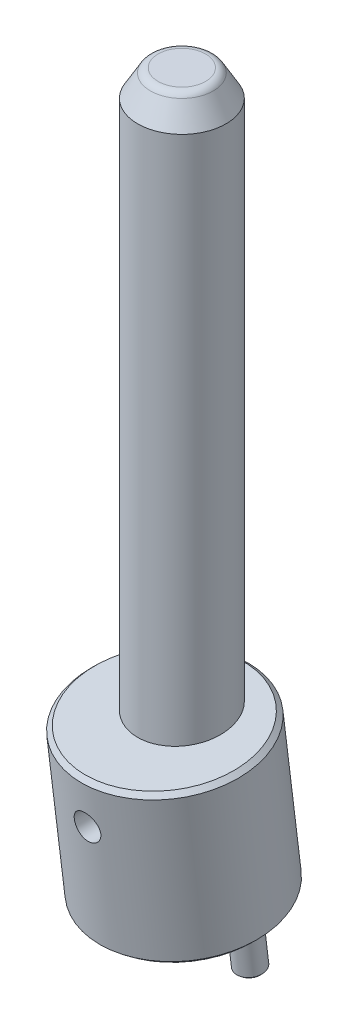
ISO-10303-21;
HEADER;
FILE_DESCRIPTION(('STEP AP214'),'2;1');
FILE_NAME('part.step','',(''),(''),'','','');
FILE_SCHEMA(('AUTOMOTIVE_DESIGN { 1 0 10303 214 1 1 1 1 }'));
ENDSEC;
DATA;
#1=APPLICATION_CONTEXT('core data for automotive mechanical design processes');
#2=APPLICATION_PROTOCOL_DEFINITION('international standard','automotive_design',2000,#1);
#3=PRODUCT_CONTEXT('',#1,'mechanical');
#4=PRODUCT('Part','Part','',(#3));
#5=PRODUCT_RELATED_PRODUCT_CATEGORY('part','',(#4));
#6=PRODUCT_DEFINITION_FORMATION('','',#4);
#7=PRODUCT_DEFINITION_CONTEXT('part definition',#1,'design');
#8=PRODUCT_DEFINITION('design','',#6,#7);
#9=PRODUCT_DEFINITION_SHAPE('','',#8);
#10=(LENGTH_UNIT() NAMED_UNIT(*) SI_UNIT(.MILLI.,.METRE.));
#11=(NAMED_UNIT(*) PLANE_ANGLE_UNIT() SI_UNIT($,.RADIAN.));
#12=(NAMED_UNIT(*) SI_UNIT($,.STERADIAN.) SOLID_ANGLE_UNIT());
#13=UNCERTAINTY_MEASURE_WITH_UNIT(LENGTH_MEASURE(1.E-05),#10,'distance_accuracy_value','');
#14=(GEOMETRIC_REPRESENTATION_CONTEXT(3) GLOBAL_UNCERTAINTY_ASSIGNED_CONTEXT((#13)) GLOBAL_UNIT_ASSIGNED_CONTEXT((#10,
#11,#12)) REPRESENTATION_CONTEXT('',''));
#15=CARTESIAN_POINT('',(0.,0.,0.));
#16=DIRECTION('',(0.,0.,1.));
#17=DIRECTION('',(1.,0.,0.));
#18=AXIS2_PLACEMENT_3D('',#15,#16,#17);
#19=CARTESIAN_POINT('',(0.,155.,0.));
#20=DIRECTION('',(0.,1.,0.));
#21=DIRECTION('',(-1.,0.,0.));
#22=AXIS2_PLACEMENT_3D('',#19,#20,#21);
#23=PLANE('',#22);
#24=CARTESIAN_POINT('',(0.,155.,0.));
#25=DIRECTION('',(0.,-1.,0.));
#26=DIRECTION('',(0.,0.,-1.));
#27=AXIS2_PLACEMENT_3D('',#24,#25,#26);
#28=CIRCLE('',#27,5.38119780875);
#29=CARTESIAN_POINT('',(0.,155.,-5.3811978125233));
#30=VERTEX_POINT('',#29);
#31=CARTESIAN_POINT('',(0.,155.,5.3811978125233));
#32=VERTEX_POINT('',#31);
#33=EDGE_CURVE('P0_E38',#30,#32,#28,.T.);
#34=ORIENTED_EDGE('',*,*,#33,.F.);
#35=CARTESIAN_POINT('',(0.,155.,0.));
#36=DIRECTION('',(0.,-1.,0.));
#37=DIRECTION('',(0.,0.,1.));
#38=AXIS2_PLACEMENT_3D('',#35,#36,#37);
#39=CIRCLE('',#38,5.38119780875);
#40=EDGE_CURVE('P0_E42',#32,#30,#39,.T.);
#41=ORIENTED_EDGE('',*,*,#40,.F.);
#42=EDGE_LOOP('',(#34,#41));
#43=FACE_BOUND('',#42,.T.);
#44=ADVANCED_FACE('P0_F17',(#43),#23,.T.);
#45=CARTESIAN_POINT('',(0.,153.,0.));
#46=DIRECTION('',(0.,1.,0.));
#47=DIRECTION('',(0.00894115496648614,0.,0.999960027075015));
#48=AXIS2_PLACEMENT_3D('',#45,#46,#47);
#49=TOROIDAL_SURFACE('',#48,5.381197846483,2.);
#50=ORIENTED_EDGE('',*,*,#33,.T.);
#51=ORIENTED_EDGE('',*,*,#40,.T.);
#52=EDGE_LOOP('',(#50,#51));
#53=FACE_BOUND('',#52,.T.);
#54=CARTESIAN_POINT('',(0.,154.000000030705,0.));
#55=DIRECTION('',(0.,-1.,0.));
#56=DIRECTION('',(0.,0.,1.));
#57=AXIS2_PLACEMENT_3D('',#54,#55,#56);
#58=CIRCLE('',#57,7.11324863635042);
#59=CARTESIAN_POINT('',(0.,154.000000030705,7.11324863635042));
#60=VERTEX_POINT('',#59);
#61=EDGE_CURVE('P0_E48',#60,#60,#58,.T.);
#62=ORIENTED_EDGE('',*,*,#61,.F.);
#63=EDGE_LOOP('',(#62));
#64=FACE_BOUND('',#63,.T.);
#65=ADVANCED_FACE('P0_F40',(#53,#64),#49,.T.);
#66=CARTESIAN_POINT('',(0.,0.,0.));
#67=DIRECTION('',(0.,1.,0.));
#68=DIRECTION('',(-1.,0.,0.));
#69=AXIS2_PLACEMENT_3D('',#66,#67,#68);
#70=PLANE('',#69);
#71=CARTESIAN_POINT('',(0.,3.21873874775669E-07,0.));
#72=DIRECTION('',(0.,1.,0.));
#73=DIRECTION('',(-1.,0.,0.));
#74=AXIS2_PLACEMENT_3D('',#71,#72,#73);
#75=CIRCLE('',#74,8.99999919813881);
#76=CARTESIAN_POINT('',(-8.99999919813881,3.21873874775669E-07,0.));
#77=VERTEX_POINT('',#76);
#78=EDGE_CURVE('P0_E85',#77,#77,#75,.T.);
#79=ORIENTED_EDGE('',*,*,#78,.F.);
#80=EDGE_LOOP('',(#79));
#81=FACE_BOUND('',#80,.T.);
#82=ADVANCED_FACE('P0_F76',(#81),#70,.F.);
#83=CARTESIAN_POINT('',(0.,17.,3.73205080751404));
#84=DIRECTION('',(0.,0.,1.));
#85=DIRECTION('',(-1.,0.,0.));
#86=AXIS2_PLACEMENT_3D('',#83,#84,#85);
#87=CONICAL_SURFACE('',#86,2.99999999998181,1.04719755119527);
#88=CARTESIAN_POINT('',(0.,16.9999999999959,1.99999999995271));
#89=VERTEX_POINT('',#88);
#90=VERTEX_LOOP('',#89);
#91=FACE_BOUND('',#90,.T.);
#92=CARTESIAN_POINT('',(0.,17.,3.732050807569));
#93=DIRECTION('',(0.,0.,1.));
#94=DIRECTION('',(0.,-1.,0.));
#95=AXIS2_PLACEMENT_3D('',#92,#93,#94);
#96=CIRCLE('',#95,3.);
#97=CARTESIAN_POINT('',(0.,14.,3.732050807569));
#98=VERTEX_POINT('',#97);
#99=EDGE_CURVE('P0_E82',#98,#98,#96,.T.);
#100=ORIENTED_EDGE('',*,*,#99,.T.);
#101=EDGE_LOOP('',(#100));
#102=FACE_BOUND('',#101,.T.);
#103=ADVANCED_FACE('P0_F116',(#91,#102),#87,.F.);
#104=CARTESIAN_POINT('',(0.,149.000000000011,0.));
#105=DIRECTION('',(0.,-1.,0.));
#106=DIRECTION('',(1.,0.,0.));
#107=AXIS2_PLACEMENT_3D('',#104,#105,#106);
#108=CONICAL_SURFACE('',#107,10.0000000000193,0.5235987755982);
#109=CARTESIAN_POINT('',(0.,149.,0.));
#110=DIRECTION('',(0.,1.,0.));
#111=DIRECTION('',(-1.,0.,0.));
#112=AXIS2_PLACEMENT_3D('',#109,#110,#111);
#113=CIRCLE('',#112,10.);
#114=CARTESIAN_POINT('',(-10.,149.,0.));
#115=VERTEX_POINT('',#114);
#116=EDGE_CURVE('P0_E92',#115,#115,#113,.F.);
#117=ORIENTED_EDGE('',*,*,#116,.F.);
#118=EDGE_LOOP('',(#117));
#119=FACE_BOUND('',#118,.T.);
#120=ORIENTED_EDGE('',*,*,#61,.T.);
#121=EDGE_LOOP('',(#120));
#122=FACE_BOUND('',#121,.T.);
#123=ADVANCED_FACE('P0_F108',(#119,#122),#108,.T.);
#124=CARTESIAN_POINT('',(0.,1.00000089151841,0.));
#125=DIRECTION('',(0.,1.,0.));
#126=DIRECTION('',(-1.,0.,0.));
#127=AXIS2_PLACEMENT_3D('',#124,#125,#126);
#128=CONICAL_SURFACE('',#127,9.99999964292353,0.785398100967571);
#129=CARTESIAN_POINT('',(0.,1.000000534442,0.));
#130=DIRECTION('',(0.,1.,0.));
#131=DIRECTION('',(-1.,0.,0.));
#132=AXIS2_PLACEMENT_3D('',#129,#130,#131);
#133=CIRCLE('',#132,10.);
#134=CARTESIAN_POINT('',(-10.,1.000000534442,0.));
#135=VERTEX_POINT('',#134);
#136=EDGE_CURVE('P0_E28',#135,#135,#133,.T.);
#137=ORIENTED_EDGE('',*,*,#136,.F.);
#138=EDGE_LOOP('',(#137));
#139=FACE_BOUND('',#138,.T.);
#140=ORIENTED_EDGE('',*,*,#78,.T.);
#141=EDGE_LOOP('',(#140));
#142=FACE_BOUND('',#141,.T.);
#143=ADVANCED_FACE('P0_F105',(#139,#142),#128,.T.);
#144=CARTESIAN_POINT('',(0.,17.,1.5));
#145=DIRECTION('',(0.,0.,1.));
#146=DIRECTION('',(0.,-1.,0.));
#147=AXIS2_PLACEMENT_3D('',#144,#145,#146);
#148=CYLINDRICAL_SURFACE('',#147,3.);
#149=ORIENTED_EDGE('',*,*,#99,.F.);
#150=EDGE_LOOP('',(#149));
#151=FACE_BOUND('',#150,.T.);
#152=CARTESIAN_POINT('',(0.,14.,10.));
#153=CARTESIAN_POINT('',(-0.164364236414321,14.0000089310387,9.99999407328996));
#154=CARTESIAN_POINT('',(-0.328908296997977,14.0135695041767,9.99590322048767));
#155=CARTESIAN_POINT('',(-0.653366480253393,14.0673818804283,9.9799606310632));
#156=CARTESIAN_POINT('',(-0.813271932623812,14.1076806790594,9.96809523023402));
#157=CARTESIAN_POINT('',(-1.12348315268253,14.2135007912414,9.93790838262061));
#158=CARTESIAN_POINT('',(-1.27380789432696,14.2789703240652,9.91960019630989));
#159=CARTESIAN_POINT('',(-1.56129290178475,14.4330996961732,9.87843514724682));
#160=CARTESIAN_POINT('',(-1.69845550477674,14.5217554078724,9.85557909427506));
#161=CARTESIAN_POINT('',(-1.95973946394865,14.7224452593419,9.80701539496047));
#162=CARTESIAN_POINT('',(-2.08342924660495,14.8350271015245,9.78124907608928));
#163=CARTESIAN_POINT('',(-2.31049290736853,15.0792112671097,9.73011807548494));
#164=CARTESIAN_POINT('',(-2.41386225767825,15.2108178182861,9.70475348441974));
#165=CARTESIAN_POINT('',(-2.59960101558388,15.4929419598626,9.65668220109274));
#166=CARTESIAN_POINT('',(-2.68144668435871,15.6438178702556,9.63404799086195));
#167=CARTESIAN_POINT('',(-2.81842825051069,15.9579795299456,9.59487230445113));
#168=CARTESIAN_POINT('',(-2.87357072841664,16.1212622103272,9.57832932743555));
#169=CARTESIAN_POINT('',(-2.95403265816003,16.4507804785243,9.5538174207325));
#170=CARTESIAN_POINT('',(-2.98014390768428,16.6168053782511,9.54562139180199));
#171=CARTESIAN_POINT('',(-3.00427461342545,16.9510662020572,9.53805579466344));
#172=CARTESIAN_POINT('',(-3.00230085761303,17.1193015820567,9.53868409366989));
#173=CARTESIAN_POINT('',(-2.9709395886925,17.4467673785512,9.54849486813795));
#174=CARTESIAN_POINT('',(-2.94254427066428,17.6061036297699,9.55736772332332));
#175=CARTESIAN_POINT('',(-2.86074869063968,17.9176387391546,9.58216703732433));
#176=CARTESIAN_POINT('',(-2.80734582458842,18.0698368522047,9.59809423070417));
#177=CARTESIAN_POINT('',(-2.67631861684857,18.3652051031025,9.6354552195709));
#178=CARTESIAN_POINT('',(-2.59837186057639,18.5082226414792,9.65696160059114));
#179=CARTESIAN_POINT('',(-2.42069837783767,18.7794716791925,9.70302119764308));
#180=CARTESIAN_POINT('',(-2.32096766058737,18.9077004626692,9.7275749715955));
#181=CARTESIAN_POINT('',(-2.09764727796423,19.1513495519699,9.77821549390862));
#182=CARTESIAN_POINT('',(-1.97323765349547,19.2660150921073,9.80432352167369));
#183=CARTESIAN_POINT('',(-1.7065766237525,19.4730741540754,9.85423611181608));
#184=CARTESIAN_POINT('',(-1.56431758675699,19.5654580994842,9.87803968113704));
#185=CARTESIAN_POINT('',(-1.26458300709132,19.7257915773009,9.92088257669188));
#186=CARTESIAN_POINT('',(-1.10700242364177,19.7935547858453,9.93988525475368));
#187=CARTESIAN_POINT('',(-0.782158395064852,19.9012737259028,9.97069163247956));
#188=CARTESIAN_POINT('',(-0.61491570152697,19.9412868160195,9.9825101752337));
#189=CARTESIAN_POINT('',(-0.371824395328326,19.9778051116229,9.99335985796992));
#190=CARTESIAN_POINT('',(-0.297737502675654,19.9861188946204,9.99584304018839));
#191=CARTESIAN_POINT('',(-0.14911274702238,19.9972183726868,9.99916445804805));
#192=CARTESIAN_POINT('',(-0.0745748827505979,20.000004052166,10.0000026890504));
#193=CARTESIAN_POINT('',(0.164364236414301,19.9999910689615,9.99999407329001));
#194=CARTESIAN_POINT('',(0.328908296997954,19.9864304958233,9.99590322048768));
#195=CARTESIAN_POINT('',(0.653366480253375,19.9326181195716,9.97996063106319));
#196=CARTESIAN_POINT('',(0.813271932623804,19.8923193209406,9.96809523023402));
#197=CARTESIAN_POINT('',(1.12348315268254,19.7864992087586,9.93790838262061));
#198=CARTESIAN_POINT('',(1.27380789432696,19.7210296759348,9.91960019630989));
#199=CARTESIAN_POINT('',(1.56129290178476,19.5669003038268,9.87843514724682));
#200=CARTESIAN_POINT('',(1.69845550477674,19.4782445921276,9.85557909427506));
#201=CARTESIAN_POINT('',(1.95973946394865,19.2775547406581,9.80701539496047));
#202=CARTESIAN_POINT('',(2.08342924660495,19.1649728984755,9.78124907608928));
#203=CARTESIAN_POINT('',(2.31049290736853,18.9207887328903,9.73011807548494));
#204=CARTESIAN_POINT('',(2.41386225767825,18.7891821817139,9.70475348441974));
#205=CARTESIAN_POINT('',(2.59960101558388,18.5070580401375,9.65668220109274));
#206=CARTESIAN_POINT('',(2.68144668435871,18.3561821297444,9.63404799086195));
#207=CARTESIAN_POINT('',(2.81842825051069,18.0420204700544,9.59487230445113));
#208=CARTESIAN_POINT('',(2.87357072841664,17.8787377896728,9.57832932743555));
#209=CARTESIAN_POINT('',(2.95403265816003,17.5492195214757,9.5538174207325));
#210=CARTESIAN_POINT('',(2.98014390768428,17.3831946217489,9.54562139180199));
#211=CARTESIAN_POINT('',(3.00427461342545,17.0489337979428,9.53805579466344));
#212=CARTESIAN_POINT('',(3.00230085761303,16.8806984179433,9.53868409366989));
#213=CARTESIAN_POINT('',(2.9709395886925,16.5532326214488,9.54849486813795));
#214=CARTESIAN_POINT('',(2.94254427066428,16.3938963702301,9.55736772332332));
#215=CARTESIAN_POINT('',(2.86074869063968,16.0823612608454,9.58216703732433));
#216=CARTESIAN_POINT('',(2.80734582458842,15.9301631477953,9.59809423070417));
#217=CARTESIAN_POINT('',(2.67631861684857,15.6347948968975,9.6354552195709));
#218=CARTESIAN_POINT('',(2.59837186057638,15.4917773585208,9.65696160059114));
#219=CARTESIAN_POINT('',(2.42069837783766,15.2205283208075,9.70302119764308));
#220=CARTESIAN_POINT('',(2.32096766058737,15.0922995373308,9.7275749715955));
#221=CARTESIAN_POINT('',(2.09764727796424,14.8486504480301,9.77821549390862));
#222=CARTESIAN_POINT('',(1.97323765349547,14.7339849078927,9.80432352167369));
#223=CARTESIAN_POINT('',(1.7065766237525,14.5269258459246,9.85423611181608));
#224=CARTESIAN_POINT('',(1.56431758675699,14.4345419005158,9.87803968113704));
#225=CARTESIAN_POINT('',(1.26458300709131,14.2742084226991,9.92088257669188));
#226=CARTESIAN_POINT('',(1.10700242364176,14.2064452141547,9.93988525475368));
#227=CARTESIAN_POINT('',(0.782158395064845,14.0987262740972,9.97069163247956));
#228=CARTESIAN_POINT('',(0.614915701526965,14.0587131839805,9.9825101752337));
#229=CARTESIAN_POINT('',(0.371824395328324,14.0221948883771,9.99335985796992));
#230=CARTESIAN_POINT('',(0.297737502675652,14.0138811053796,9.9958430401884));
#231=CARTESIAN_POINT('',(0.149112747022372,14.0027816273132,9.99916445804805));
#232=CARTESIAN_POINT('',(0.0745748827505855,13.999995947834,10.0000026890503));
#233=CARTESIAN_POINT('',(0.,14.,10.));
#234=B_SPLINE_CURVE_WITH_KNOTS('',3,(#152,#153,#154,#155,#156,#157,#158,#159,#160,#161,#162,
#163,#164,#165,#166,#167,#168,#169,#170,#171,#172,#173,#174,#175,#176,#177,#178,#179,#180,#181,
#182,#183,#184,#185,#186,#187,#188,#189,#190,#191,#192,#193,#194,#195,#196,#197,#198,#199,#200,
#201,#202,#203,#204,#205,#206,#207,#208,#209,#210,#211,#212,#213,#214,#215,#216,#217,#218,#219,
#220,#221,#222,#223,#224,#225,#226,#227,#228,#229,#230,#231,#232,#233),.UNSPECIFIED.,.T.,.F.,(4,
2,2,2,2,2,2,2,2,2,2,2,2,2,2,2,2,2,2,2,2,2,2,2,2,2,2,2,2,2,2,2,2,2,2,2,2,2,2,2,4),(0.,
0.49280574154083,0.98647994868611,1.47914396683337,1.97172034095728,2.47709830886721,
2.98258875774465,3.49943124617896,4.01614630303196,4.51839363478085,5.02051957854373,
5.50451902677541,5.98856888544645,6.47926306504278,6.97004721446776,7.48124851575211,
7.99266913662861,8.507883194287,9.02202912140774,9.24562293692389,9.4692173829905,
9.96202312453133,10.4556973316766,10.9483613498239,11.4409377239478,11.9463156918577,
12.4518061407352,12.9686486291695,13.4853636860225,13.9876110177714,14.4897369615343,
14.9737364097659,15.457786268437,15.9484804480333,16.4392645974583,16.9504658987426,
17.4618865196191,17.9771005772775,18.4912465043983,18.7148403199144,18.938434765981),.UNSPECIFIED.);
#235=CARTESIAN_POINT('',(0.,14.,10.));
#236=VERTEX_POINT('',#235);
#237=EDGE_CURVE('P0_E11',#236,#236,#234,.T.);
#238=ORIENTED_EDGE('',*,*,#237,.F.);
#239=EDGE_LOOP('',(#238));
#240=FACE_BOUND('',#239,.T.);
#241=ADVANCED_FACE('P0_F107',(#151,#240),#148,.F.);
#242=CARTESIAN_POINT('',(0.,-7.75,0.));
#243=DIRECTION('',(0.,1.,0.));
#244=DIRECTION('',(-1.,0.,0.));
#245=AXIS2_PLACEMENT_3D('',#242,#243,#244);
#246=CYLINDRICAL_SURFACE('',#245,10.);
#247=ORIENTED_EDGE('',*,*,#116,.T.);
#248=EDGE_LOOP('',(#247));
#249=FACE_BOUND('',#248,.T.);
#250=ORIENTED_EDGE('',*,*,#136,.T.);
#251=EDGE_LOOP('',(#250));
#252=FACE_BOUND('',#251,.T.);
#253=ORIENTED_EDGE('',*,*,#237,.T.);
#254=EDGE_LOOP('',(#253));
#255=FACE_BOUND('',#254,.T.);
#256=ADVANCED_FACE('P0_F102',(#249,#252,#255),#246,.T.);
#257=CLOSED_SHELL('',(#44,#65,#82,#103,#123,#143,#241,#256));
#258=MANIFOLD_SOLID_BREP('P0_B1',#257);
#259=CARTESIAN_POINT('',(0.,-15.1520541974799,-1.51393584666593));
#260=DIRECTION('',(0.,-0.992546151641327,-0.121869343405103));
#261=DIRECTION('',(0.,0.121869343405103,-0.992546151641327));
#262=AXIS2_PLACEMENT_3D('',#259,#260,#261);
#263=PLANE('',#262);
#264=CARTESIAN_POINT('',(-14.,-15.1520541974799,-1.51393584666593));
#265=DIRECTION('',(0.,-0.992546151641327,-0.121869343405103));
#266=DIRECTION('',(0.,0.121869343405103,-0.992546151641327));
#267=AXIS2_PLACEMENT_3D('',#264,#265,#266);
#268=CIRCLE('',#267,2.49998893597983);
#269=CARTESIAN_POINT('',(-14.,-14.8473821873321,-3.99529024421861));
#270=VERTEX_POINT('',#269);
#271=EDGE_CURVE('P1_E17',#270,#270,#268,.F.);
#272=ORIENTED_EDGE('',*,*,#271,.F.);
#273=EDGE_LOOP('',(#272));
#274=FACE_BOUND('',#273,.T.);
#275=ADVANCED_FACE('P1_F14',(#274),#263,.T.);
#276=CARTESIAN_POINT('',(0.,-15.1520541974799,-1.51393584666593));
#277=DIRECTION('',(0.,-0.992546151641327,-0.121869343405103));
#278=DIRECTION('',(0.,0.121869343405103,-0.992546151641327));
#279=AXIS2_PLACEMENT_3D('',#276,#277,#278);
#280=PLANE('',#279);
#281=CARTESIAN_POINT('',(14.,-15.1520541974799,-1.51393584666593));
#282=DIRECTION('',(0.,-0.992546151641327,-0.121869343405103));
#283=DIRECTION('',(0.,0.121869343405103,-0.992546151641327));
#284=AXIS2_PLACEMENT_3D('',#281,#282,#283);
#285=CIRCLE('',#284,2.49998893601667);
#286=CARTESIAN_POINT('',(14.,-14.8473821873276,-3.99529024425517));
#287=VERTEX_POINT('',#286);
#288=EDGE_CURVE('P1_E114',#287,#287,#285,.F.);
#289=ORIENTED_EDGE('',*,*,#288,.F.);
#290=EDGE_LOOP('',(#289));
#291=FACE_BOUND('',#290,.T.);
#292=ADVANCED_FACE('P1_F104',(#291),#280,.T.);
#293=CARTESIAN_POINT('',(0.,-1.32706345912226E-13,-3.20815422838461E-13));
#294=DIRECTION('',(0.,-1.,0.));
#295=DIRECTION('',(0.,0.,-1.));
#296=AXIS2_PLACEMENT_3D('',#293,#294,#295);
#297=PLANE('',#296);
#298=CARTESIAN_POINT('',(0.,0.,-2.03098171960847E-12));
#299=DIRECTION('',(0.,-1.,0.));
#300=DIRECTION('',(0.,0.,-1.));
#301=AXIS2_PLACEMENT_3D('',#298,#299,#300);
#302=CIRCLE('',#301,10.);
#303=CARTESIAN_POINT('',(0.,0.,-10.000000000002));
#304=VERTEX_POINT('',#303);
#305=EDGE_CURVE('P1_E116',#304,#304,#302,.F.);
#306=ORIENTED_EDGE('',*,*,#305,.T.);
#307=EDGE_LOOP('',(#306));
#308=FACE_BOUND('',#307,.T.);
#309=ADVANCED_FACE('P1_F101',(#308),#297,.F.);
#310=CARTESIAN_POINT('',(-14.,-14.6557726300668,-1.45300013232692));
#311=DIRECTION('',(0.,0.992546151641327,0.121869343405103));
#312=DIRECTION('',(0.,-0.121869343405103,0.992546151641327));
#313=AXIS2_PLACEMENT_3D('',#310,#311,#312);
#314=CONICAL_SURFACE('',#313,2.99999527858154,0.785395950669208);
#315=CARTESIAN_POINT('',(-14.,-14.6557679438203,-1.4529995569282));
#316=DIRECTION('',(0.,0.992546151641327,0.121869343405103));
#317=DIRECTION('',(0.,-0.121869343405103,0.992546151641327));
#318=AXIS2_PLACEMENT_3D('',#315,#316,#317);
#319=CIRCLE('',#318,3.);
#320=CARTESIAN_POINT('',(-14.,-15.0213759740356,1.52463889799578));
#321=VERTEX_POINT('',#320);
#322=EDGE_CURVE('P1_E118',#321,#321,#319,.T.);
#323=ORIENTED_EDGE('',*,*,#322,.F.);
#324=EDGE_LOOP('',(#323));
#325=FACE_BOUND('',#324,.T.);
#326=ORIENTED_EDGE('',*,*,#271,.T.);
#327=EDGE_LOOP('',(#326));
#328=FACE_BOUND('',#327,.T.);
#329=ADVANCED_FACE('P1_F97',(#325,#328),#314,.T.);
#330=CARTESIAN_POINT('',(14.,-14.6557726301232,-1.45300013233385));
#331=DIRECTION('',(0.,0.992546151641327,0.121869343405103));
#332=DIRECTION('',(0.,-0.121869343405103,0.992546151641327));
#333=AXIS2_PLACEMENT_3D('',#330,#331,#332);
#334=CONICAL_SURFACE('',#333,2.99999527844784,0.785395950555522);
#335=CARTESIAN_POINT('',(14.,-14.655767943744,-1.45299955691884));
#336=DIRECTION('',(0.,0.992546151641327,0.121869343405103));
#337=DIRECTION('',(0.,-0.121869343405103,0.992546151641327));
#338=AXIS2_PLACEMENT_3D('',#335,#336,#337);
#339=CIRCLE('',#338,3.);
#340=CARTESIAN_POINT('',(14.,-15.0213759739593,1.52463889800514));
#341=VERTEX_POINT('',#340);
#342=EDGE_CURVE('P1_E123',#341,#341,#339,.T.);
#343=ORIENTED_EDGE('',*,*,#342,.F.);
#344=EDGE_LOOP('',(#343));
#345=FACE_BOUND('',#344,.T.);
#346=ORIENTED_EDGE('',*,*,#288,.T.);
#347=EDGE_LOOP('',(#346));
#348=FACE_BOUND('',#347,.T.);
#349=ADVANCED_FACE('P1_F92',(#345,#348),#334,.T.);
#350=CARTESIAN_POINT('',(0.,43.3305704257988,-2.03092750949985E-12));
#351=DIRECTION('',(0.,-1.,0.));
#352=DIRECTION('',(0.,0.,-1.));
#353=AXIS2_PLACEMENT_3D('',#350,#351,#352);
#354=CYLINDRICAL_SURFACE('',#353,10.);
#355=CARTESIAN_POINT('',(0.,30.0000000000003,-2.03092750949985E-12));
#356=DIRECTION('',(0.,0.992546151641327,0.121869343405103));
#357=DIRECTION('',(0.,-0.121869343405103,0.992546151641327));
#358=AXIS2_PLACEMENT_3D('',#355,#356,#357);
#359=ELLIPSE('',#358,10.0750982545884,10.);
#360=CARTESIAN_POINT('',(0.,28.7721543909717,9.99999999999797));
#361=VERTEX_POINT('',#360);
#362=EDGE_CURVE('P1_E79',#361,#361,#359,.F.);
#363=ORIENTED_EDGE('',*,*,#362,.F.);
#364=EDGE_LOOP('',(#363));
#365=FACE_BOUND('',#364,.T.);
#366=ORIENTED_EDGE('',*,*,#305,.F.);
#367=EDGE_LOOP('',(#366));
#368=FACE_BOUND('',#367,.T.);
#369=CARTESIAN_POINT('',(0.,20.0000000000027,9.99999999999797));
#370=CARTESIAN_POINT('',(-0.16436423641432,19.999991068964,9.99999407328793));
#371=CARTESIAN_POINT('',(-0.328908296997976,19.986430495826,9.99590322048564));
#372=CARTESIAN_POINT('',(-0.653366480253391,19.9326181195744,9.97996063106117));
#373=CARTESIAN_POINT('',(-0.81327193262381,19.8923193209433,9.96809523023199));
#374=CARTESIAN_POINT('',(-1.12348315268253,19.7864992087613,9.93790838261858));
#375=CARTESIAN_POINT('',(-1.27380789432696,19.7210296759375,9.91960019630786));
#376=CARTESIAN_POINT('',(-1.56129290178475,19.5669003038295,9.87843514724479));
#377=CARTESIAN_POINT('',(-1.69845550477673,19.4782445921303,9.85557909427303));
#378=CARTESIAN_POINT('',(-1.95973946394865,19.2775547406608,9.80701539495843));
#379=CARTESIAN_POINT('',(-2.08342924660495,19.1649728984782,9.78124907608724));
#380=CARTESIAN_POINT('',(-2.31049290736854,18.920788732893,9.73011807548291));
#381=CARTESIAN_POINT('',(-2.41386225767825,18.7891821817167,9.70475348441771));
#382=CARTESIAN_POINT('',(-2.59960101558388,18.5070580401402,9.65668220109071));
#383=CARTESIAN_POINT('',(-2.68144668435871,18.3561821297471,9.63404799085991));
#384=CARTESIAN_POINT('',(-2.81842825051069,18.0420204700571,9.5948723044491));
#385=CARTESIAN_POINT('',(-2.87357072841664,17.8787377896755,9.57832932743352));
#386=CARTESIAN_POINT('',(-2.95403265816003,17.5492195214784,9.55381742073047));
#387=CARTESIAN_POINT('',(-2.98014390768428,17.3831946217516,9.54562139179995));
#388=CARTESIAN_POINT('',(-3.00427461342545,17.0489337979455,9.53805579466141));
#389=CARTESIAN_POINT('',(-3.00230085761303,16.8806984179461,9.53868409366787));
#390=CARTESIAN_POINT('',(-2.9709395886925,16.5532326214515,9.54849486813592));
#391=CARTESIAN_POINT('',(-2.94254427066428,16.3938963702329,9.55736772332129));
#392=CARTESIAN_POINT('',(-2.86074869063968,16.0823612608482,9.5821670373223));
#393=CARTESIAN_POINT('',(-2.80734582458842,15.9301631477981,9.59809423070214));
#394=CARTESIAN_POINT('',(-2.67631861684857,15.6347948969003,9.63545521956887));
#395=CARTESIAN_POINT('',(-2.59837186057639,15.4917773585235,9.65696160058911));
#396=CARTESIAN_POINT('',(-2.42069837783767,15.2205283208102,9.70302119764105));
#397=CARTESIAN_POINT('',(-2.32096766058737,15.0922995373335,9.72757497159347));
#398=CARTESIAN_POINT('',(-2.09764727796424,14.8486504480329,9.77821549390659));
#399=CARTESIAN_POINT('',(-1.97323765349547,14.7339849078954,9.80432352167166));
#400=CARTESIAN_POINT('',(-1.7065766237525,14.5269258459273,9.85423611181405));
#401=CARTESIAN_POINT('',(-1.56431758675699,14.4345419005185,9.87803968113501));
#402=CARTESIAN_POINT('',(-1.26458300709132,14.2742084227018,9.92088257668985));
#403=CARTESIAN_POINT('',(-1.10700242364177,14.2064452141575,9.93988525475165));
#404=CARTESIAN_POINT('',(-0.782158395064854,14.0987262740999,9.97069163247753));
#405=CARTESIAN_POINT('',(-0.614915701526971,14.0587131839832,9.98251017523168));
#406=CARTESIAN_POINT('',(-0.371824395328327,14.0221948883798,9.99335985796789));
#407=CARTESIAN_POINT('',(-0.297737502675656,14.0138811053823,9.99584304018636));
#408=CARTESIAN_POINT('',(-0.149112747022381,14.0027816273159,9.99916445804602));
#409=CARTESIAN_POINT('',(-0.0745748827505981,13.9999959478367,10.0000026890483));
#410=CARTESIAN_POINT('',(0.164364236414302,14.0000089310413,9.99999407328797));
#411=CARTESIAN_POINT('',(0.328908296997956,14.0135695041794,9.99590322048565));
#412=CARTESIAN_POINT('',(0.653366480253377,14.0673818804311,9.97996063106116));
#413=CARTESIAN_POINT('',(0.813271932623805,14.1076806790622,9.96809523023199));
#414=CARTESIAN_POINT('',(1.12348315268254,14.2135007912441,9.93790838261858));
#415=CARTESIAN_POINT('',(1.27380789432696,14.2789703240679,9.91960019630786));
#416=CARTESIAN_POINT('',(1.56129290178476,14.4330996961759,9.87843514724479));
#417=CARTESIAN_POINT('',(1.69845550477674,14.5217554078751,9.85557909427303));
#418=CARTESIAN_POINT('',(1.95973946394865,14.7224452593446,9.80701539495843));
#419=CARTESIAN_POINT('',(2.08342924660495,14.8350271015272,9.78124907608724));
#420=CARTESIAN_POINT('',(2.31049290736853,15.0792112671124,9.73011807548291));
#421=CARTESIAN_POINT('',(2.41386225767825,15.2108178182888,9.70475348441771));
#422=CARTESIAN_POINT('',(2.59960101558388,15.4929419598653,9.65668220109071));
#423=CARTESIAN_POINT('',(2.68144668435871,15.6438178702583,9.63404799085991));
#424=CARTESIAN_POINT('',(2.81842825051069,15.9579795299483,9.5948723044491));
#425=CARTESIAN_POINT('',(2.87357072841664,16.1212622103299,9.57832932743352));
#426=CARTESIAN_POINT('',(2.95403265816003,16.450780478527,9.55381742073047));
#427=CARTESIAN_POINT('',(2.98014390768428,16.6168053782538,9.54562139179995));
#428=CARTESIAN_POINT('',(3.00427461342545,16.9510662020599,9.53805579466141));
#429=CARTESIAN_POINT('',(3.00230085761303,17.1193015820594,9.53868409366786));
#430=CARTESIAN_POINT('',(2.9709395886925,17.4467673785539,9.54849486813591));
#431=CARTESIAN_POINT('',(2.94254427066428,17.6061036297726,9.55736772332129));
#432=CARTESIAN_POINT('',(2.86074869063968,17.9176387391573,9.5821670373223));
#433=CARTESIAN_POINT('',(2.80734582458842,18.0698368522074,9.59809423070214));
#434=CARTESIAN_POINT('',(2.67631861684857,18.3652051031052,9.63545521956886));
#435=CARTESIAN_POINT('',(2.59837186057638,18.5082226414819,9.65696160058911));
#436=CARTESIAN_POINT('',(2.42069837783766,18.7794716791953,9.70302119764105));
#437=CARTESIAN_POINT('',(2.32096766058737,18.9077004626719,9.72757497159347));
#438=CARTESIAN_POINT('',(2.09764727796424,19.1513495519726,9.77821549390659));
#439=CARTESIAN_POINT('',(1.97323765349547,19.26601509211,9.80432352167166));
#440=CARTESIAN_POINT('',(1.7065766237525,19.4730741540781,9.85423611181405));
#441=CARTESIAN_POINT('',(1.56431758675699,19.5654580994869,9.87803968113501));
#442=CARTESIAN_POINT('',(1.26458300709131,19.7257915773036,9.92088257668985));
#443=CARTESIAN_POINT('',(1.10700242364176,19.793554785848,9.93988525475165));
#444=CARTESIAN_POINT('',(0.782158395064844,19.9012737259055,9.97069163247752));
#445=CARTESIAN_POINT('',(0.614915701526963,19.9412868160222,9.98251017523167));
#446=CARTESIAN_POINT('',(0.371824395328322,19.9778051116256,9.99335985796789));
#447=CARTESIAN_POINT('',(0.297737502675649,19.9861188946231,9.99584304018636));
#448=CARTESIAN_POINT('',(0.149112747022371,19.9972183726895,9.99916445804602));
#449=CARTESIAN_POINT('',(0.0745748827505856,20.0000040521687,10.0000026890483));
#450=CARTESIAN_POINT('',(0.,20.0000000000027,9.99999999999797));
#451=B_SPLINE_CURVE_WITH_KNOTS('',3,(#369,#370,#371,#372,#373,#374,#375,#376,#377,#378,#379,
#380,#381,#382,#383,#384,#385,#386,#387,#388,#389,#390,#391,#392,#393,#394,#395,#396,#397,#398,
#399,#400,#401,#402,#403,#404,#405,#406,#407,#408,#409,#410,#411,#412,#413,#414,#415,#416,#417,
#418,#419,#420,#421,#422,#423,#424,#425,#426,#427,#428,#429,#430,#431,#432,#433,#434,#435,#436,
#437,#438,#439,#440,#441,#442,#443,#444,#445,#446,#447,#448,#449,#450),.UNSPECIFIED.,.T.,.F.,(4,
2,2,2,2,2,2,2,2,2,2,2,2,2,2,2,2,2,2,2,2,2,2,2,2,2,2,2,2,2,2,2,2,2,2,2,2,2,2,2,4),(0.,
0.49280574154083,0.986479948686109,1.47914396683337,1.97172034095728,2.47709830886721,
2.98258875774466,3.49943124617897,4.01614630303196,4.51839363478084,5.02051957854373,
5.50451902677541,5.98856888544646,6.47926306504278,6.97004721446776,7.48124851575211,
7.99266913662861,8.507883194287,9.02202912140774,9.24562293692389,9.46921738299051,
9.96202312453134,10.4556973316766,10.9483613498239,11.4409377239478,11.9463156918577,
12.4518061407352,12.9686486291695,13.4853636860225,13.9876110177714,14.4897369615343,
14.9737364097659,15.457786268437,15.9484804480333,16.4392645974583,16.9504658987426,
17.4618865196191,17.9771005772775,18.4912465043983,18.7148403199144,18.9384347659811),.UNSPECIFIED.);
#452=CARTESIAN_POINT('',(0.,20.0000000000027,9.99999999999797));
#453=VERTEX_POINT('',#452);
#454=EDGE_CURVE('P1_E76',#453,#453,#451,.T.);
#455=ORIENTED_EDGE('',*,*,#454,.T.);
#456=EDGE_LOOP('',(#455));
#457=FACE_BOUND('',#456,.T.);
#458=ADVANCED_FACE('P1_F86',(#365,#368,#457),#354,.F.);
#459=CARTESIAN_POINT('',(-14.,-6.219138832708,-0.41711175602));
#460=DIRECTION('',(0.,-0.992546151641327,-0.121869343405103));
#461=DIRECTION('',(0.,0.121869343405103,-0.992546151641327));
#462=AXIS2_PLACEMENT_3D('',#459,#460,#461);
#463=CYLINDRICAL_SURFACE('',#462,3.);
#464=CARTESIAN_POINT('',(-14.,-6.219138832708,-0.41711175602));
#465=DIRECTION('',(0.,-0.992546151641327,-0.121869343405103));
#466=DIRECTION('',(0.,0.121869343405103,-0.992546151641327));
#467=AXIS2_PLACEMENT_3D('',#464,#465,#466);
#468=CIRCLE('',#467,3.);
#469=CARTESIAN_POINT('',(-14.,-5.85353080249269,-3.39475021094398));
#470=VERTEX_POINT('',#469);
#471=EDGE_CURVE('P1_E72',#470,#470,#468,.T.);
#472=ORIENTED_EDGE('',*,*,#471,.T.);
#473=EDGE_LOOP('',(#472));
#474=FACE_BOUND('',#473,.T.);
#475=ORIENTED_EDGE('',*,*,#322,.T.);
#476=EDGE_LOOP('',(#475));
#477=FACE_BOUND('',#476,.T.);
#478=ADVANCED_FACE('P1_F91',(#474,#477),#463,.T.);
#479=CARTESIAN_POINT('',(14.,-6.219138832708,-0.41711175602));
#480=DIRECTION('',(0.,-0.992546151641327,-0.121869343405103));
#481=DIRECTION('',(0.,0.121869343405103,-0.992546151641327));
#482=AXIS2_PLACEMENT_3D('',#479,#480,#481);
#483=CYLINDRICAL_SURFACE('',#482,3.);
#484=CARTESIAN_POINT('',(14.,-6.219138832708,-0.41711175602));
#485=DIRECTION('',(0.,-0.992546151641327,-0.121869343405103));
#486=DIRECTION('',(0.,0.121869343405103,-0.992546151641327));
#487=AXIS2_PLACEMENT_3D('',#484,#485,#486);
#488=CIRCLE('',#487,3.);
#489=CARTESIAN_POINT('',(14.,-5.85353080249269,-3.39475021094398));
#490=VERTEX_POINT('',#489);
#491=EDGE_CURVE('P1_E68',#490,#490,#488,.T.);
#492=ORIENTED_EDGE('',*,*,#491,.T.);
#493=EDGE_LOOP('',(#492));
#494=FACE_BOUND('',#493,.T.);
#495=ORIENTED_EDGE('',*,*,#342,.T.);
#496=EDGE_LOOP('',(#495));
#497=FACE_BOUND('',#496,.T.);
#498=ADVANCED_FACE('P1_F139',(#494,#497),#483,.T.);
#499=CARTESIAN_POINT('',(0.,29.5125226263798,3.97018460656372));
#500=DIRECTION('',(0.,0.992546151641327,0.121869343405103));
#501=DIRECTION('',(0.,-0.121869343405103,0.992546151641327));
#502=AXIS2_PLACEMENT_3D('',#499,#500,#501);
#503=PLANE('',#502);
#504=ORIENTED_EDGE('',*,*,#362,.T.);
#505=EDGE_LOOP('',(#504));
#506=FACE_BOUND('',#505,.T.);
#507=CARTESIAN_POINT('',(0.,29.5125226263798,3.9701846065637));
#508=DIRECTION('',(0.,0.992546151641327,0.121869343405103));
#509=DIRECTION('',(0.,-0.121869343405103,0.992546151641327));
#510=AXIS2_PLACEMENT_3D('',#507,#508,#509);
#511=CIRCLE('',#510,17.9999935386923);
#512=CARTESIAN_POINT('',(0.,27.3188752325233,21.8360089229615));
#513=VERTEX_POINT('',#512);
#514=EDGE_CURVE('P1_E38',#513,#513,#511,.F.);
#515=ORIENTED_EDGE('',*,*,#514,.F.);
#516=EDGE_LOOP('',(#515));
#517=FACE_BOUND('',#516,.T.);
#518=ADVANCED_FACE('P1_F63',(#506,#517),#503,.T.);
#519=CARTESIAN_POINT('',(0.,17.0000000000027,-3.70003727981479));
#520=DIRECTION('',(0.,0.,1.));
#521=DIRECTION('',(0.,-1.,0.));
#522=AXIS2_PLACEMENT_3D('',#519,#520,#521);
#523=CYLINDRICAL_SURFACE('',#522,3.);
#524=ORIENTED_EDGE('',*,*,#454,.F.);
#525=EDGE_LOOP('',(#524));
#526=FACE_BOUND('',#525,.T.);
#527=CARTESIAN_POINT('',(0.,14.0000000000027,21.2081730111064));
#528=CARTESIAN_POINT('',(-0.168375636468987,14.000007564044,21.2081708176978));
#529=CARTESIAN_POINT('',(-0.336958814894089,14.0142312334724,21.2076402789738));
#530=CARTESIAN_POINT('',(-0.669566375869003,14.0707956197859,21.2057130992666));
#531=CARTESIAN_POINT('',(-0.833581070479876,14.1131919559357,21.2043147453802));
#532=CARTESIAN_POINT('',(-1.15205522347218,14.2248959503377,21.2012396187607));
#533=CARTESIAN_POINT('',(-1.30652215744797,14.2941822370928,21.1995630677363));
#534=CARTESIAN_POINT('',(-1.60156617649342,14.4576731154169,21.1968228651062));
#535=CARTESIAN_POINT('',(-1.74214908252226,14.5518672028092,21.1957589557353));
#536=CARTESIAN_POINT('',(-2.00554261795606,14.7625371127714,21.1953276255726));
#537=CARTESIAN_POINT('',(-2.12834999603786,14.8790170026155,21.1959605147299));
#538=CARTESIAN_POINT('',(-2.3526557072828,15.1309218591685,21.2000562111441));
#539=CARTESIAN_POINT('',(-2.45415323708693,15.2663475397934,21.2035191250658));
#540=CARTESIAN_POINT('',(-2.63254643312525,15.551595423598,21.2142654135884));
#541=CARTESIAN_POINT('',(-2.70954499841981,15.7013538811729,21.2215324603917));
#542=CARTESIAN_POINT('',(-2.83737969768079,16.0113712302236,21.2405952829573));
#543=CARTESIAN_POINT('',(-2.88821737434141,16.1716295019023,21.252390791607));
#544=CARTESIAN_POINT('',(-2.96225674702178,16.4972232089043,21.2807457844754));
#545=CARTESIAN_POINT('',(-2.98558245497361,16.6625323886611,21.2972834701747));
#546=CARTESIAN_POINT('',(-3.00459042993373,16.9942055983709,21.3349508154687));
#547=CARTESIAN_POINT('',(-3.00027160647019,17.1605696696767,21.3560806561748));
#548=CARTESIAN_POINT('',(-2.9642365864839,17.4910773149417,21.4024316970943));
#549=CARTESIAN_POINT('',(-2.93230247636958,17.65519265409,21.4276841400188));
#550=CARTESIAN_POINT('',(-2.84186394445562,17.9754520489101,21.4810141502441));
#551=CARTESIAN_POINT('',(-2.78335584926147,18.1315949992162,21.5090921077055));
#552=CARTESIAN_POINT('',(-2.64001667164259,18.4349283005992,21.5671655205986));
#553=CARTESIAN_POINT('',(-2.55467438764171,18.5818719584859,21.5971883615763));
#554=CARTESIAN_POINT('',(-2.36040600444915,18.8593465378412,21.6567869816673));
#555=CARTESIAN_POINT('',(-2.25147933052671,18.9898770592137,21.6863627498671));
#556=CARTESIAN_POINT('',(-2.0116154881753,19.2322107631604,21.7434078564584));
#557=CARTESIAN_POINT('',(-1.88046287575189,19.3438068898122,21.7708523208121));
#558=CARTESIAN_POINT('',(-1.60035758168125,19.5433076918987,21.8213051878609));
#559=CARTESIAN_POINT('',(-1.45139855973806,19.6312038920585,21.8443120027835));
#560=CARTESIAN_POINT('',(-1.14272283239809,19.7790218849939,21.883718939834));
#561=CARTESIAN_POINT('',(-0.983245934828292,19.8394155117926,21.9002297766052));
#562=CARTESIAN_POINT('',(-0.656050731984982,19.9323006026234,21.9258599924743));
#563=CARTESIAN_POINT('',(-0.488353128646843,19.9648586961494,21.9349970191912));
#564=CARTESIAN_POINT('',(-0.266232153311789,19.9886415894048,21.9416818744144));
#565=CARTESIAN_POINT('',(-0.213088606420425,19.992897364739,21.9428794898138));
#566=CARTESIAN_POINT('',(-0.106637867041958,19.9985778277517,21.9444793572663));
#567=CARTESIAN_POINT('',(-0.0533306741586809,20.0000025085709,21.9448816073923));
#568=CARTESIAN_POINT('',(0.164356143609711,19.9999922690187,21.9448765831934));
#569=CARTESIAN_POINT('',(0.328935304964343,19.9864295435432,21.9410406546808));
#570=CARTESIAN_POINT('',(0.653541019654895,19.9325856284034,21.9259781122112));
#571=CARTESIAN_POINT('',(0.813557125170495,19.8922475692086,21.9147357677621));
#572=CARTESIAN_POINT('',(1.12402944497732,19.7862873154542,21.8857527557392));
#573=CARTESIAN_POINT('',(1.27450305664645,19.7207127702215,21.8680243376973));
#574=CARTESIAN_POINT('',(1.56216881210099,19.5663745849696,21.8273798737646));
#575=CARTESIAN_POINT('',(1.69936540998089,19.4776187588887,21.804465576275));
#576=CARTESIAN_POINT('',(1.95987302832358,19.2773770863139,21.7545069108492));
#577=CARTESIAN_POINT('',(2.08283374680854,19.1654547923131,21.7273862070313));
#578=CARTESIAN_POINT('',(2.30845456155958,18.9231375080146,21.6711894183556));
#579=CARTESIAN_POINT('',(2.4111098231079,18.7927381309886,21.6421128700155));
#580=CARTESIAN_POINT('',(2.59623248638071,18.5127945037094,21.5829616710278));
#581=CARTESIAN_POINT('',(2.67802121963,18.3628016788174,21.5528827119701));
#582=CARTESIAN_POINT('',(2.81509396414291,18.0508440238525,21.4944052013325));
#583=CARTESIAN_POINT('',(2.87037734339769,17.8888789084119,21.4660066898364));
#584=CARTESIAN_POINT('',(2.95281854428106,17.5569391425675,21.4123704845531));
#585=CARTESIAN_POINT('',(2.97989932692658,17.3869438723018,21.3871416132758));
#586=CARTESIAN_POINT('',(3.00458761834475,17.0442359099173,21.3410961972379));
#587=CARTESIAN_POINT('',(3.00219875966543,16.8715235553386,21.3202791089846));
#588=CARTESIAN_POINT('',(2.96806290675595,16.53183043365,21.2840404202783));
#589=CARTESIAN_POINT('',(2.93687920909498,16.3648032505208,21.2685230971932));
#590=CARTESIAN_POINT('',(2.84664339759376,16.0380535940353,21.2424022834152));
#591=CARTESIAN_POINT('',(2.7875933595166,15.8783305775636,21.2317984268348));
#592=CARTESIAN_POINT('',(2.64432821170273,15.5732906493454,21.2151852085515));
#593=CARTESIAN_POINT('',(2.56050413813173,15.427793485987,21.2091092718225));
#594=CARTESIAN_POINT('',(2.36973535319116,15.1527418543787,21.2004847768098));
#595=CARTESIAN_POINT('',(2.26279233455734,15.0231862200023,21.1979359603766));
#596=CARTESIAN_POINT('',(2.02876719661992,14.783662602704,21.1953244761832));
#597=CARTESIAN_POINT('',(1.90167888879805,14.6737006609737,21.1952625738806));
#598=CARTESIAN_POINT('',(1.63088940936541,14.4764579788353,21.1965152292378));
#599=CARTESIAN_POINT('',(1.48718067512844,14.3891876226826,21.1978304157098));
#600=CARTESIAN_POINT('',(1.18628909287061,14.2393544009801,21.2008217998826));
#601=CARTESIAN_POINT('',(1.02902570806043,14.1769536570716,21.2025002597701));
#602=CARTESIAN_POINT('',(0.706461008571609,14.0795207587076,21.2053879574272));
#603=CARTESIAN_POINT('',(0.541176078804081,14.0444351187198,21.2065981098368));
#604=CARTESIAN_POINT('',(0.312244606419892,14.0156349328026,21.2076109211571));
#605=CARTESIAN_POINT('',(0.249948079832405,14.0097763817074,21.207820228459));
#606=CARTESIAN_POINT('',(0.125110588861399,14.001957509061,21.2081016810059));
#607=CARTESIAN_POINT('',(0.0625696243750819,13.9999971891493,21.2081738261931));
#608=CARTESIAN_POINT('',(0.,14.0000000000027,21.2081730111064));
#609=B_SPLINE_CURVE_WITH_KNOTS('',3,(#527,#528,#529,#530,#531,#532,#533,#534,#535,#536,#537,
#538,#539,#540,#541,#542,#543,#544,#545,#546,#547,#548,#549,#550,#551,#552,#553,#554,#555,#556,
#557,#558,#559,#560,#561,#562,#563,#564,#565,#566,#567,#568,#569,#570,#571,#572,#573,#574,#575,
#576,#577,#578,#579,#580,#581,#582,#583,#584,#585,#586,#587,#588,#589,#590,#591,#592,#593,#594,
#595,#596,#597,#598,#599,#600,#601,#602,#603,#604,#605,#606,#607,#608),.UNSPECIFIED.,.T.,.F.,(4,
2,2,2,2,2,2,2,2,2,2,2,2,2,2,2,2,2,2,2,2,2,2,2,2,2,2,2,2,2,2,2,2,2,2,2,2,2,2,2,4),(0.,
0.504891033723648,1.0107818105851,1.51627133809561,2.02154802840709,2.52691702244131,
3.03230506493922,3.53554149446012,4.03874824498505,4.53967798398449,5.04062748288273,
5.54556644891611,6.05057523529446,6.56585585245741,7.08114902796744,7.60175733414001,
8.12255156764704,8.63403921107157,9.14429905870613,9.30422329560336,9.46414791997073,
9.95700864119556,10.4509195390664,10.9439024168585,11.4367193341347,11.9398402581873,
12.443080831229,12.9610478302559,13.4790271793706,13.9984177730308,14.5177443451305,
15.0271220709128,15.5364618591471,16.0381563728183,16.5398141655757,17.0416263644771,
17.5436678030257,18.0489304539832,18.5532012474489,18.7408223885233,18.9284436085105),.UNSPECIFIED.);
#610=CARTESIAN_POINT('',(0.,14.0000000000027,21.2081730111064));
#611=VERTEX_POINT('',#610);
#612=EDGE_CURVE('P1_E31',#611,#611,#609,.T.);
#613=ORIENTED_EDGE('',*,*,#612,.F.);
#614=EDGE_LOOP('',(#613));
#615=FACE_BOUND('',#614,.T.);
#616=ADVANCED_FACE('P1_F40',(#526,#615),#523,.F.);
#617=CARTESIAN_POINT('',(0.,-6.219138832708,-0.41711175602));
#618=DIRECTION('',(0.,0.992546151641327,0.121869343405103));
#619=DIRECTION('',(0.,-0.121869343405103,0.992546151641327));
#620=AXIS2_PLACEMENT_3D('',#617,#618,#619);
#621=PLANE('',#620);
#622=ORIENTED_EDGE('',*,*,#491,.F.);
#623=EDGE_LOOP('',(#622));
#624=FACE_BOUND('',#623,.T.);
#625=ORIENTED_EDGE('',*,*,#471,.F.);
#626=EDGE_LOOP('',(#625));
#627=FACE_BOUND('',#626,.T.);
#628=CARTESIAN_POINT('',(0.,-6.219138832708,-0.417111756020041));
#629=DIRECTION('',(0.,0.992546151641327,0.121869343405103));
#630=DIRECTION('',(0.,-0.121869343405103,0.992546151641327));
#631=AXIS2_PLACEMENT_3D('',#628,#629,#630);
#632=CIRCLE('',#631,17.9999934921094);
#633=CARTESIAN_POINT('',(0.,-8.4127862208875,17.448712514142));
#634=VERTEX_POINT('',#633);
#635=EDGE_CURVE('P1_E26',#634,#634,#632,.T.);
#636=ORIENTED_EDGE('',*,*,#635,.F.);
#637=EDGE_LOOP('',(#636));
#638=FACE_BOUND('',#637,.T.);
#639=ADVANCED_FACE('P1_F55',(#624,#627,#638),#621,.F.);
#640=CARTESIAN_POINT('',(0.,28.5199727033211,3.84831480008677));
#641=DIRECTION('',(0.,-0.992546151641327,-0.121869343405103));
#642=DIRECTION('',(0.,0.121869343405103,-0.992546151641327));
#643=AXIS2_PLACEMENT_3D('',#640,#641,#642);
#644=CONICAL_SURFACE('',#643,18.9999969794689,0.785397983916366);
#645=ORIENTED_EDGE('',*,*,#514,.T.);
#646=EDGE_LOOP('',(#645));
#647=FACE_BOUND('',#646,.T.);
#648=CARTESIAN_POINT('',(0.,28.5199757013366,3.84831516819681));
#649=DIRECTION('',(0.,0.992546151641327,0.121869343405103));
#650=DIRECTION('',(0.,-0.121869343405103,0.992546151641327));
#651=AXIS2_PLACEMENT_3D('',#648,#649,#650);
#652=CIRCLE('',#651,19.);
#653=CARTESIAN_POINT('',(0.,26.2044581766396,22.706692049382));
#654=VERTEX_POINT('',#653);
#655=EDGE_CURVE('P1_E21',#654,#654,#652,.F.);
#656=ORIENTED_EDGE('',*,*,#655,.F.);
#657=EDGE_LOOP('',(#656));
#658=FACE_BOUND('',#657,.T.);
#659=ADVANCED_FACE('P1_F52',(#647,#658),#644,.T.);
#660=CARTESIAN_POINT('',(0.,-5.22658879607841,-0.295241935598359));
#661=DIRECTION('',(0.,0.992546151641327,0.121869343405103));
#662=DIRECTION('',(0.,-0.121869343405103,0.992546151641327));
#663=AXIS2_PLACEMENT_3D('',#660,#661,#662);
#664=CONICAL_SURFACE('',#663,18.9999970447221,0.785397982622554);
#665=CARTESIAN_POINT('',(0.,-5.22659172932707,-0.295242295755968));
#666=DIRECTION('',(0.,0.992546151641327,0.121869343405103));
#667=DIRECTION('',(0.,-0.121869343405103,0.992546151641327));
#668=AXIS2_PLACEMENT_3D('',#665,#666,#667);
#669=CIRCLE('',#668,19.);
#670=CARTESIAN_POINT('',(0.,-7.54210925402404,18.5631345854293));
#671=VERTEX_POINT('',#670);
#672=EDGE_CURVE('P1_E9',#671,#671,#669,.T.);
#673=ORIENTED_EDGE('',*,*,#672,.F.);
#674=EDGE_LOOP('',(#673));
#675=FACE_BOUND('',#674,.T.);
#676=ORIENTED_EDGE('',*,*,#635,.T.);
#677=EDGE_LOOP('',(#676));
#678=FACE_BOUND('',#677,.T.);
#679=ADVANCED_FACE('P1_F48',(#675,#678),#664,.T.);
#680=CARTESIAN_POINT('',(0.,-8.00572190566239,-0.636476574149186));
#681=DIRECTION('',(0.,0.992546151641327,0.121869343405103));
#682=DIRECTION('',(0.,-0.121869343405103,0.992546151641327));
#683=AXIS2_PLACEMENT_3D('',#680,#681,#682);
#684=CYLINDRICAL_SURFACE('',#683,19.);
#685=ORIENTED_EDGE('',*,*,#655,.T.);
#686=EDGE_LOOP('',(#685));
#687=FACE_BOUND('',#686,.T.);
#688=ORIENTED_EDGE('',*,*,#672,.T.);
#689=EDGE_LOOP('',(#688));
#690=FACE_BOUND('',#689,.T.);
#691=ORIENTED_EDGE('',*,*,#612,.T.);
#692=EDGE_LOOP('',(#691));
#693=FACE_BOUND('',#692,.T.);
#694=ADVANCED_FACE('P1_F44',(#687,#690,#693),#684,.T.);
#695=CLOSED_SHELL('',(#275,#292,#309,#329,#349,#458,#478,#498,#518,#616,#639,#659,#679,#694));
#696=MANIFOLD_SOLID_BREP('P1_B1',#695);
#697=ADVANCED_BREP_SHAPE_REPRESENTATION('',(#18,#258,#696),#14);
#698=SHAPE_DEFINITION_REPRESENTATION(#9,#697);
ENDSEC;
END-ISO-10303-21;
